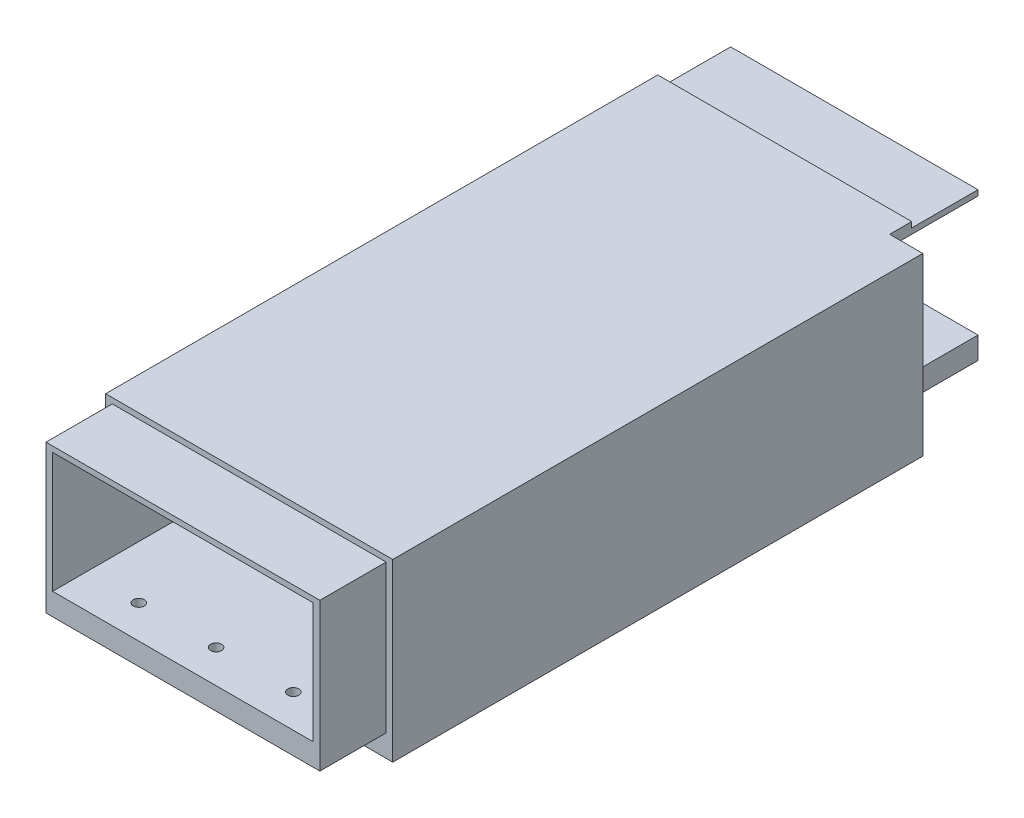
ISO-10303-21;
HEADER;
FILE_DESCRIPTION(('STEP AP214'),'2;1');
FILE_NAME('part.step','',(''),(''),'','','');
FILE_SCHEMA(('AUTOMOTIVE_DESIGN { 1 0 10303 214 1 1 1 1 }'));
ENDSEC;
DATA;
#1=APPLICATION_CONTEXT('core data for automotive mechanical design processes');
#2=APPLICATION_PROTOCOL_DEFINITION('international standard','automotive_design',2000,#1);
#3=PRODUCT_CONTEXT('',#1,'mechanical');
#4=PRODUCT('Part','Part','',(#3));
#5=PRODUCT_RELATED_PRODUCT_CATEGORY('part','',(#4));
#6=PRODUCT_DEFINITION_FORMATION('','',#4);
#7=PRODUCT_DEFINITION_CONTEXT('part definition',#1,'design');
#8=PRODUCT_DEFINITION('design','',#6,#7);
#9=PRODUCT_DEFINITION_SHAPE('','',#8);
#10=(LENGTH_UNIT() NAMED_UNIT(*) SI_UNIT(.MILLI.,.METRE.));
#11=(NAMED_UNIT(*) PLANE_ANGLE_UNIT() SI_UNIT($,.RADIAN.));
#12=(NAMED_UNIT(*) SI_UNIT($,.STERADIAN.) SOLID_ANGLE_UNIT());
#13=UNCERTAINTY_MEASURE_WITH_UNIT(LENGTH_MEASURE(1.E-05),#10,'distance_accuracy_value','');
#14=(GEOMETRIC_REPRESENTATION_CONTEXT(3) GLOBAL_UNCERTAINTY_ASSIGNED_CONTEXT((#13)) GLOBAL_UNIT_ASSIGNED_CONTEXT((#10,
#11,#12)) REPRESENTATION_CONTEXT('',''));
#15=CARTESIAN_POINT('',(0.,0.,0.));
#16=DIRECTION('',(0.,0.,1.));
#17=DIRECTION('',(1.,0.,0.));
#18=AXIS2_PLACEMENT_3D('',#15,#16,#17);
#19=CARTESIAN_POINT('',(-119.30239365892,140.01739571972,1571.88680099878));
#20=DIRECTION('',(0.,-1.,0.));
#21=DIRECTION('',(0.,0.,-1.));
#22=AXIS2_PLACEMENT_3D('',#19,#20,#21);
#23=PLANE('',#22);
#24=DIRECTION('',(0.,0.,1.));
#25=VECTOR('',#24,1.);
#26=CARTESIAN_POINT('',(-7.30239365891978,140.01739571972,1571.88680099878));
#27=LINE('',#26,#25);
#28=CARTESIAN_POINT('',(-7.30239365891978,140.01739571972,1400.00000000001));
#29=VERTEX_POINT('',#28);
#30=CARTESIAN_POINT('',(-7.30239365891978,140.01739571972,1430.00000000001));
#31=VERTEX_POINT('',#30);
#32=EDGE_CURVE('E211',#29,#31,#27,.T.);
#33=ORIENTED_EDGE('',*,*,#32,.F.);
#34=DIRECTION('',(-1.,0.,0.));
#35=VECTOR('',#34,1.);
#36=CARTESIAN_POINT('',(-119.30239365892,140.01739571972,1400.00000000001));
#37=LINE('',#36,#35);
#38=CARTESIAN_POINT('',(-119.30239365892,140.01739571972,1400.00000000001));
#39=VERTEX_POINT('',#38);
#40=EDGE_CURVE('E361',#29,#39,#37,.T.);
#41=ORIENTED_EDGE('',*,*,#40,.T.);
#42=DIRECTION('',(0.,0.,-1.));
#43=VECTOR('',#42,1.);
#44=CARTESIAN_POINT('',(-119.30239365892,140.01739571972,1571.88680099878));
#45=LINE('',#44,#43);
#46=CARTESIAN_POINT('',(-119.30239365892,140.01739571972,1430.00000000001));
#47=VERTEX_POINT('',#46);
#48=EDGE_CURVE('E47',#47,#39,#45,.T.);
#49=ORIENTED_EDGE('',*,*,#48,.F.);
#50=DIRECTION('',(-1.,0.,0.));
#51=VECTOR('',#50,1.);
#52=CARTESIAN_POINT('',(-119.30239365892,140.01739571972,1430.00000000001));
#53=LINE('',#52,#51);
#54=EDGE_CURVE('E328',#31,#47,#53,.T.);
#55=ORIENTED_EDGE('',*,*,#54,.F.);
#56=EDGE_LOOP('',(#33,#41,#49,#55));
#57=FACE_BOUND('',#56,.T.);
#58=ADVANCED_FACE('F39',(#57),#23,.F.);
#59=CARTESIAN_POINT('',(-119.30239365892,73.0246653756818,1571.88680099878));
#60=DIRECTION('',(0.,1.,0.));
#61=DIRECTION('',(0.,0.,1.));
#62=AXIS2_PLACEMENT_3D('',#59,#60,#61);
#63=PLANE('',#62);
#64=CARTESIAN_POINT('',(-22.3023936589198,73.0246653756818,1415.00000000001));
#65=DIRECTION('',(0.,-1.,0.));
#66=DIRECTION('',(0.,0.,-1.));
#67=AXIS2_PLACEMENT_3D('',#64,#65,#66);
#68=CIRCLE('',#67,2.49999999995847);
#69=CARTESIAN_POINT('',(-22.3023936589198,73.0246653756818,1412.50000000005));
#70=VERTEX_POINT('',#69);
#71=EDGE_CURVE('E231',#70,#70,#68,.T.);
#72=ORIENTED_EDGE('',*,*,#71,.F.);
#73=EDGE_LOOP('',(#72));
#74=FACE_BOUND('',#73,.T.);
#75=CARTESIAN_POINT('',(-57.3023936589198,73.0246653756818,1415.00000000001));
#76=DIRECTION('',(0.,-1.,0.));
#77=DIRECTION('',(0.,0.,-1.));
#78=AXIS2_PLACEMENT_3D('',#75,#76,#77);
#79=CIRCLE('',#78,2.49999999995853);
#80=CARTESIAN_POINT('',(-57.3023936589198,73.0246653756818,1412.50000000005));
#81=VERTEX_POINT('',#80);
#82=EDGE_CURVE('E252',#81,#81,#79,.T.);
#83=ORIENTED_EDGE('',*,*,#82,.F.);
#84=EDGE_LOOP('',(#83));
#85=FACE_BOUND('',#84,.T.);
#86=CARTESIAN_POINT('',(-92.3023936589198,73.0246653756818,1415.00000000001));
#87=DIRECTION('',(0.,-1.,0.));
#88=DIRECTION('',(0.,0.,-1.));
#89=AXIS2_PLACEMENT_3D('',#86,#87,#88);
#90=CIRCLE('',#89,2.49999999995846);
#91=CARTESIAN_POINT('',(-92.3023936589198,73.0246653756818,1412.50000000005));
#92=VERTEX_POINT('',#91);
#93=EDGE_CURVE('E242',#92,#92,#90,.T.);
#94=ORIENTED_EDGE('',*,*,#93,.F.);
#95=EDGE_LOOP('',(#94));
#96=FACE_BOUND('',#95,.T.);
#97=DIRECTION('',(0.,0.,-1.));
#98=VECTOR('',#97,1.);
#99=CARTESIAN_POINT('',(-7.30239365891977,73.0246653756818,1571.88680099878));
#100=LINE('',#99,#98);
#101=CARTESIAN_POINT('',(-7.30239365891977,73.0246653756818,1430.00000000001));
#102=VERTEX_POINT('',#101);
#103=CARTESIAN_POINT('',(-7.30239365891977,73.0246653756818,1400.00000000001));
#104=VERTEX_POINT('',#103);
#105=EDGE_CURVE('E204',#102,#104,#100,.T.);
#106=ORIENTED_EDGE('',*,*,#105,.F.);
#107=DIRECTION('',(1.,0.,0.));
#108=VECTOR('',#107,1.);
#109=CARTESIAN_POINT('',(-119.30239365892,73.0246653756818,1430.00000000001));
#110=LINE('',#109,#108);
#111=CARTESIAN_POINT('',(-119.30239365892,73.0246653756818,1430.00000000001));
#112=VERTEX_POINT('',#111);
#113=EDGE_CURVE('E330',#112,#102,#110,.T.);
#114=ORIENTED_EDGE('',*,*,#113,.F.);
#115=DIRECTION('',(0.,0.,-1.));
#116=VECTOR('',#115,1.);
#117=CARTESIAN_POINT('',(-119.30239365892,73.0246653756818,1571.88680099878));
#118=LINE('',#117,#116);
#119=CARTESIAN_POINT('',(-119.30239365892,73.0246653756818,1400.00000000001));
#120=VERTEX_POINT('',#119);
#121=EDGE_CURVE('E11',#112,#120,#118,.T.);
#122=ORIENTED_EDGE('',*,*,#121,.T.);
#123=DIRECTION('',(1.,0.,0.));
#124=VECTOR('',#123,1.);
#125=CARTESIAN_POINT('',(-119.30239365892,73.0246653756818,1400.00000000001));
#126=LINE('',#125,#124);
#127=EDGE_CURVE('E358',#120,#104,#126,.T.);
#128=ORIENTED_EDGE('',*,*,#127,.T.);
#129=EDGE_LOOP('',(#106,#114,#122,#128));
#130=FACE_BOUND('',#129,.T.);
#131=ADVANCED_FACE('F378',(#74,#85,#96,#130),#63,.F.);
#132=CARTESIAN_POINT('',(0.,0.,1400.00000000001));
#133=DIRECTION('',(0.,0.,1.));
#134=DIRECTION('',(1.,0.,0.));
#135=AXIS2_PLACEMENT_3D('',#132,#133,#134);
#136=PLANE('',#135);
#137=DIRECTION('',(0.,1.,0.));
#138=VECTOR('',#137,1.);
#139=CARTESIAN_POINT('',(-7.30239365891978,142.51739571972,1400.00000000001));
#140=LINE('',#139,#138);
#141=CARTESIAN_POINT('',(-7.30239365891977,83.0246653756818,1400.00000000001));
#142=VERTEX_POINT('',#141);
#143=EDGE_CURVE('E186',#104,#142,#140,.T.);
#144=ORIENTED_EDGE('',*,*,#143,.F.);
#145=ORIENTED_EDGE('',*,*,#127,.F.);
#146=DIRECTION('',(0.,-1.,0.));
#147=VECTOR('',#146,1.);
#148=CARTESIAN_POINT('',(-119.30239365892,140.01739571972,1400.00000000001));
#149=LINE('',#148,#147);
#150=EDGE_CURVE('E355',#39,#120,#149,.T.);
#151=ORIENTED_EDGE('',*,*,#150,.F.);
#152=ORIENTED_EDGE('',*,*,#40,.F.);
#153=CARTESIAN_POINT('',(-7.30239365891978,137.51739571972,1400.00000000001));
#154=VERTEX_POINT('',#153);
#155=EDGE_CURVE('E382',#154,#29,#140,.T.);
#156=ORIENTED_EDGE('',*,*,#155,.F.);
#157=DIRECTION('',(-1.,0.,0.));
#158=VECTOR('',#157,1.);
#159=CARTESIAN_POINT('',(-116.30239365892,137.51739571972,1400.00000000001));
#160=LINE('',#159,#158);
#161=CARTESIAN_POINT('',(-116.30239365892,137.51739571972,1400.00000000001));
#162=VERTEX_POINT('',#161);
#163=EDGE_CURVE('E342',#154,#162,#160,.T.);
#164=ORIENTED_EDGE('',*,*,#163,.T.);
#165=DIRECTION('',(0.,-1.,0.));
#166=VECTOR('',#165,1.);
#167=CARTESIAN_POINT('',(-116.30239365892,137.51739571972,1400.00000000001));
#168=LINE('',#167,#166);
#169=CARTESIAN_POINT('',(-116.30239365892,83.0246653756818,1400.00000000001));
#170=VERTEX_POINT('',#169);
#171=EDGE_CURVE('E336',#162,#170,#168,.T.);
#172=ORIENTED_EDGE('',*,*,#171,.T.);
#173=DIRECTION('',(1.,0.,0.));
#174=VECTOR('',#173,1.);
#175=CARTESIAN_POINT('',(-116.30239365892,83.0246653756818,1400.00000000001));
#176=LINE('',#175,#174);
#177=EDGE_CURVE('E339',#170,#142,#176,.T.);
#178=ORIENTED_EDGE('',*,*,#177,.T.);
#179=EDGE_LOOP('',(#144,#145,#151,#152,#156,#164,#172,#178));
#180=FACE_BOUND('',#179,.T.);
#181=ADVANCED_FACE('F374',(#180),#136,.F.);
#182=CARTESIAN_POINT('',(0.,0.,1430.00000000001));
#183=DIRECTION('',(0.,0.,-1.));
#184=DIRECTION('',(-1.,0.,0.));
#185=AXIS2_PLACEMENT_3D('',#182,#183,#184);
#186=PLANE('',#185);
#187=DIRECTION('',(-1.,0.,0.));
#188=VECTOR('',#187,1.);
#189=CARTESIAN_POINT('',(-122.30239365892,142.51739571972,1430.00000000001));
#190=LINE('',#189,#188);
#191=CARTESIAN_POINT('',(-7.30239365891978,142.51739571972,1430.00000000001));
#192=VERTEX_POINT('',#191);
#193=CARTESIAN_POINT('',(-122.30239365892,142.51739571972,1430.00000000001));
#194=VERTEX_POINT('',#193);
#195=EDGE_CURVE('E306',#192,#194,#190,.T.);
#196=ORIENTED_EDGE('',*,*,#195,.F.);
#197=DIRECTION('',(0.,-1.,0.));
#198=VECTOR('',#197,1.);
#199=CARTESIAN_POINT('',(-7.30239365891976,0.,1430.00000000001));
#200=LINE('',#199,#198);
#201=EDGE_CURVE('E182',#192,#31,#200,.T.);
#202=ORIENTED_EDGE('',*,*,#201,.T.);
#203=ORIENTED_EDGE('',*,*,#54,.T.);
#204=DIRECTION('',(0.,-1.,0.));
#205=VECTOR('',#204,1.);
#206=CARTESIAN_POINT('',(-119.30239365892,140.01739571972,1430.00000000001));
#207=LINE('',#206,#205);
#208=EDGE_CURVE('E333',#47,#112,#207,.T.);
#209=ORIENTED_EDGE('',*,*,#208,.T.);
#210=ORIENTED_EDGE('',*,*,#113,.T.);
#211=CARTESIAN_POINT('',(-7.30239365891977,63.0246653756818,1430.00000000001));
#212=VERTEX_POINT('',#211);
#213=EDGE_CURVE('E201',#102,#212,#200,.T.);
#214=ORIENTED_EDGE('',*,*,#213,.T.);
#215=DIRECTION('',(1.,0.,0.));
#216=VECTOR('',#215,1.);
#217=CARTESIAN_POINT('',(-122.30239365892,63.0246653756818,1430.00000000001));
#218=LINE('',#217,#216);
#219=CARTESIAN_POINT('',(-122.30239365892,63.0246653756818,1430.00000000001));
#220=VERTEX_POINT('',#219);
#221=EDGE_CURVE('E315',#220,#212,#218,.T.);
#222=ORIENTED_EDGE('',*,*,#221,.F.);
#223=DIRECTION('',(0.,-1.,0.));
#224=VECTOR('',#223,1.);
#225=CARTESIAN_POINT('',(-122.30239365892,63.0246653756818,1430.00000000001));
#226=LINE('',#225,#224);
#227=EDGE_CURVE('E301',#194,#220,#226,.T.);
#228=ORIENTED_EDGE('',*,*,#227,.F.);
#229=EDGE_LOOP('',(#196,#202,#203,#209,#210,#214,#222,#228));
#230=FACE_BOUND('',#229,.T.);
#231=ADVANCED_FACE('F380',(#230),#186,.T.);
#232=CARTESIAN_POINT('',(0.,0.,1680.00000000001));
#233=DIRECTION('',(0.,0.,-1.));
#234=DIRECTION('',(-1.,0.,0.));
#235=AXIS2_PLACEMENT_3D('',#232,#233,#234);
#236=PLANE('',#235);
#237=DIRECTION('',(0.,-1.,0.));
#238=VECTOR('',#237,1.);
#239=CARTESIAN_POINT('',(-122.30239365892,63.0246653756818,1680.00000000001));
#240=LINE('',#239,#238);
#241=CARTESIAN_POINT('',(-122.30239365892,142.51739571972,1680.00000000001));
#242=VERTEX_POINT('',#241);
#243=CARTESIAN_POINT('',(-122.30239365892,63.0246653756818,1680.00000000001));
#244=VERTEX_POINT('',#243);
#245=EDGE_CURVE('E302',#242,#244,#240,.T.);
#246=ORIENTED_EDGE('',*,*,#245,.T.);
#247=DIRECTION('',(1.,0.,0.));
#248=VECTOR('',#247,1.);
#249=CARTESIAN_POINT('',(-122.30239365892,63.0246653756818,1680.00000000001));
#250=LINE('',#249,#248);
#251=CARTESIAN_POINT('',(7.69760634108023,63.0246653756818,1680.00000000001));
#252=VERTEX_POINT('',#251);
#253=EDGE_CURVE('E305',#244,#252,#250,.T.);
#254=ORIENTED_EDGE('',*,*,#253,.T.);
#255=DIRECTION('',(0.,1.,0.));
#256=VECTOR('',#255,1.);
#257=CARTESIAN_POINT('',(7.69760634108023,63.0246653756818,1680.00000000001));
#258=LINE('',#257,#256);
#259=CARTESIAN_POINT('',(7.69760634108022,142.51739571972,1680.00000000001));
#260=VERTEX_POINT('',#259);
#261=EDGE_CURVE('E308',#252,#260,#258,.T.);
#262=ORIENTED_EDGE('',*,*,#261,.T.);
#263=DIRECTION('',(-1.,0.,0.));
#264=VECTOR('',#263,1.);
#265=CARTESIAN_POINT('',(-122.30239365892,142.51739571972,1680.00000000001));
#266=LINE('',#265,#264);
#267=EDGE_CURVE('E310',#260,#242,#266,.T.);
#268=ORIENTED_EDGE('',*,*,#267,.T.);
#269=EDGE_LOOP('',(#246,#254,#262,#268));
#270=FACE_BOUND('',#269,.T.);
#271=DIRECTION('',(0.,-1.,0.));
#272=VECTOR('',#271,1.);
#273=CARTESIAN_POINT('',(-119.30239365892,140.01739571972,1680.00000000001));
#274=LINE('',#273,#272);
#275=CARTESIAN_POINT('',(-119.30239365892,140.01739571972,1680.00000000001));
#276=VERTEX_POINT('',#275);
#277=CARTESIAN_POINT('',(-119.30239365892,73.0246653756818,1680.00000000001));
#278=VERTEX_POINT('',#277);
#279=EDGE_CURVE('E62',#276,#278,#274,.T.);
#280=ORIENTED_EDGE('',*,*,#279,.F.);
#281=DIRECTION('',(-1.,0.,0.));
#282=VECTOR('',#281,1.);
#283=CARTESIAN_POINT('',(-119.30239365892,140.01739571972,1680.00000000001));
#284=LINE('',#283,#282);
#285=CARTESIAN_POINT('',(4.69760634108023,140.01739571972,1680.00000000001));
#286=VERTEX_POINT('',#285);
#287=EDGE_CURVE('E275',#286,#276,#284,.T.);
#288=ORIENTED_EDGE('',*,*,#287,.F.);
#289=DIRECTION('',(0.,1.,0.));
#290=VECTOR('',#289,1.);
#291=CARTESIAN_POINT('',(4.69760634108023,140.01739571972,1680.00000000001));
#292=LINE('',#291,#290);
#293=CARTESIAN_POINT('',(4.69760634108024,73.0246653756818,1680.00000000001));
#294=VERTEX_POINT('',#293);
#295=EDGE_CURVE('E286',#294,#286,#292,.T.);
#296=ORIENTED_EDGE('',*,*,#295,.F.);
#297=DIRECTION('',(1.,0.,0.));
#298=VECTOR('',#297,1.);
#299=CARTESIAN_POINT('',(-119.30239365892,73.0246653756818,1680.00000000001));
#300=LINE('',#299,#298);
#301=EDGE_CURVE('E283',#278,#294,#300,.T.);
#302=ORIENTED_EDGE('',*,*,#301,.F.);
#303=EDGE_LOOP('',(#280,#288,#296,#302));
#304=FACE_BOUND('',#303,.T.);
#305=ADVANCED_FACE('F399',(#270,#304),#236,.F.);
#306=CARTESIAN_POINT('',(-119.30239365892,140.01739571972,1571.88680099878));
#307=DIRECTION('',(1.,0.,0.));
#308=DIRECTION('',(0.,1.,0.));
#309=AXIS2_PLACEMENT_3D('',#306,#307,#308);
#310=PLANE('',#309);
#311=ORIENTED_EDGE('',*,*,#208,.F.);
#312=ORIENTED_EDGE('',*,*,#48,.T.);
#313=ORIENTED_EDGE('',*,*,#150,.T.);
#314=ORIENTED_EDGE('',*,*,#121,.F.);
#315=EDGE_LOOP('',(#311,#312,#313,#314));
#316=FACE_BOUND('',#315,.T.);
#317=ADVANCED_FACE('F41',(#316),#310,.F.);
#318=CARTESIAN_POINT('',(-116.30239365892,137.51739571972,1571.88680099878));
#319=DIRECTION('',(0.,-1.,0.));
#320=DIRECTION('',(0.,0.,-1.));
#321=AXIS2_PLACEMENT_3D('',#318,#319,#320);
#322=PLANE('',#321);
#323=DIRECTION('',(-1.,0.,0.));
#324=VECTOR('',#323,1.);
#325=CARTESIAN_POINT('',(-116.30239365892,137.51739571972,1440.00000000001));
#326=LINE('',#325,#324);
#327=CARTESIAN_POINT('',(1.69760634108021,137.51739571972,1440.00000000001));
#328=VERTEX_POINT('',#327);
#329=CARTESIAN_POINT('',(-7.30239365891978,137.51739571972,1440.00000000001));
#330=VERTEX_POINT('',#329);
#331=EDGE_CURVE('E192',#328,#330,#326,.T.);
#332=ORIENTED_EDGE('',*,*,#331,.F.);
#333=DIRECTION('',(0.,0.,-1.));
#334=VECTOR('',#333,1.);
#335=CARTESIAN_POINT('',(1.69760634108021,137.51739571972,1571.88680099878));
#336=LINE('',#335,#334);
#337=CARTESIAN_POINT('',(1.6976063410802,137.51739571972,1710.00000000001));
#338=VERTEX_POINT('',#337);
#339=EDGE_CURVE('E347',#338,#328,#336,.T.);
#340=ORIENTED_EDGE('',*,*,#339,.F.);
#341=DIRECTION('',(-1.,0.,0.));
#342=VECTOR('',#341,1.);
#343=CARTESIAN_POINT('',(-116.30239365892,137.51739571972,1710.00000000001));
#344=LINE('',#343,#342);
#345=CARTESIAN_POINT('',(-116.30239365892,137.51739571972,1710.00000000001));
#346=VERTEX_POINT('',#345);
#347=EDGE_CURVE('E268',#338,#346,#344,.T.);
#348=ORIENTED_EDGE('',*,*,#347,.T.);
#349=DIRECTION('',(0.,0.,-1.));
#350=VECTOR('',#349,1.);
#351=CARTESIAN_POINT('',(-116.30239365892,137.51739571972,1571.88680099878));
#352=LINE('',#351,#350);
#353=EDGE_CURVE('E344',#346,#162,#352,.T.);
#354=ORIENTED_EDGE('',*,*,#353,.T.);
#355=ORIENTED_EDGE('',*,*,#163,.F.);
#356=DIRECTION('',(0.,0.,1.));
#357=VECTOR('',#356,1.);
#358=CARTESIAN_POINT('',(-7.30239365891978,137.51739571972,1571.88680099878));
#359=LINE('',#358,#357);
#360=EDGE_CURVE('E216',#154,#330,#359,.T.);
#361=ORIENTED_EDGE('',*,*,#360,.T.);
#362=EDGE_LOOP('',(#332,#340,#348,#354,#355,#361));
#363=FACE_BOUND('',#362,.T.);
#364=ADVANCED_FACE('F432',(#363),#322,.T.);
#365=CARTESIAN_POINT('',(1.69760634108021,137.51739571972,1571.88680099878));
#366=DIRECTION('',(-1.,0.,0.));
#367=DIRECTION('',(0.,-1.,0.));
#368=AXIS2_PLACEMENT_3D('',#365,#366,#367);
#369=PLANE('',#368);
#370=DIRECTION('',(0.,1.,0.));
#371=VECTOR('',#370,1.);
#372=CARTESIAN_POINT('',(1.69760634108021,137.51739571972,1440.00000000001));
#373=LINE('',#372,#371);
#374=CARTESIAN_POINT('',(1.69760634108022,83.0246653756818,1440.00000000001));
#375=VERTEX_POINT('',#374);
#376=EDGE_CURVE('E220',#375,#328,#373,.T.);
#377=ORIENTED_EDGE('',*,*,#376,.F.);
#378=DIRECTION('',(0.,0.,-1.));
#379=VECTOR('',#378,1.);
#380=CARTESIAN_POINT('',(1.69760634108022,83.0246653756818,1571.88680099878));
#381=LINE('',#380,#379);
#382=CARTESIAN_POINT('',(1.6976063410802,83.0246653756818,1710.00000000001));
#383=VERTEX_POINT('',#382);
#384=EDGE_CURVE('E350',#383,#375,#381,.T.);
#385=ORIENTED_EDGE('',*,*,#384,.F.);
#386=DIRECTION('',(0.,1.,0.));
#387=VECTOR('',#386,1.);
#388=CARTESIAN_POINT('',(1.6976063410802,137.51739571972,1710.00000000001));
#389=LINE('',#388,#387);
#390=EDGE_CURVE('E265',#383,#338,#389,.T.);
#391=ORIENTED_EDGE('',*,*,#390,.T.);
#392=ORIENTED_EDGE('',*,*,#339,.T.);
#393=EDGE_LOOP('',(#377,#385,#391,#392));
#394=FACE_BOUND('',#393,.T.);
#395=ADVANCED_FACE('F428',(#394),#369,.T.);
#396=CARTESIAN_POINT('',(-116.30239365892,83.0246653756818,1571.88680099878));
#397=DIRECTION('',(0.,1.,0.));
#398=DIRECTION('',(0.,0.,1.));
#399=AXIS2_PLACEMENT_3D('',#396,#397,#398);
#400=PLANE('',#399);
#401=DIRECTION('',(1.,0.,0.));
#402=VECTOR('',#401,1.);
#403=CARTESIAN_POINT('',(-116.30239365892,83.0246653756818,1440.00000000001));
#404=LINE('',#403,#402);
#405=CARTESIAN_POINT('',(-7.30239365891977,83.0246653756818,1440.00000000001));
#406=VERTEX_POINT('',#405);
#407=EDGE_CURVE('E218',#406,#375,#404,.T.);
#408=ORIENTED_EDGE('',*,*,#407,.F.);
#409=DIRECTION('',(0.,0.,-1.));
#410=VECTOR('',#409,1.);
#411=CARTESIAN_POINT('',(-7.30239365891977,83.0246653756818,1571.88680099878));
#412=LINE('',#411,#410);
#413=EDGE_CURVE('E213',#406,#142,#412,.T.);
#414=ORIENTED_EDGE('',*,*,#413,.T.);
#415=ORIENTED_EDGE('',*,*,#177,.F.);
#416=DIRECTION('',(0.,0.,-1.));
#417=VECTOR('',#416,1.);
#418=CARTESIAN_POINT('',(-116.30239365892,83.0246653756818,1571.88680099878));
#419=LINE('',#418,#417);
#420=CARTESIAN_POINT('',(-116.30239365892,83.0246653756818,1710.00000000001));
#421=VERTEX_POINT('',#420);
#422=EDGE_CURVE('E353',#421,#170,#419,.T.);
#423=ORIENTED_EDGE('',*,*,#422,.F.);
#424=DIRECTION('',(1.,0.,0.));
#425=VECTOR('',#424,1.);
#426=CARTESIAN_POINT('',(-116.30239365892,83.0246653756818,1710.00000000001));
#427=LINE('',#426,#425);
#428=EDGE_CURVE('E262',#421,#383,#427,.T.);
#429=ORIENTED_EDGE('',*,*,#428,.T.);
#430=ORIENTED_EDGE('',*,*,#384,.T.);
#431=EDGE_LOOP('',(#408,#414,#415,#423,#429,#430));
#432=FACE_BOUND('',#431,.T.);
#433=CARTESIAN_POINT('',(-92.3023936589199,83.0246653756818,1695.00000000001));
#434=DIRECTION('',(0.,1.,0.));
#435=DIRECTION('',(0.,0.,1.));
#436=AXIS2_PLACEMENT_3D('',#433,#434,#435);
#437=CIRCLE('',#436,2.49999999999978);
#438=CARTESIAN_POINT('',(-92.3023936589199,83.0246653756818,1697.50000000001));
#439=VERTEX_POINT('',#438);
#440=EDGE_CURVE('E224',#439,#439,#437,.F.);
#441=ORIENTED_EDGE('',*,*,#440,.T.);
#442=EDGE_LOOP('',(#441));
#443=FACE_BOUND('',#442,.T.);
#444=CARTESIAN_POINT('',(-57.3023936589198,83.0246653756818,1695.00000000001));
#445=DIRECTION('',(0.,1.,0.));
#446=DIRECTION('',(0.,0.,1.));
#447=AXIS2_PLACEMENT_3D('',#444,#445,#446);
#448=CIRCLE('',#447,2.50000000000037);
#449=CARTESIAN_POINT('',(-57.3023936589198,83.0246653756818,1697.50000000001));
#450=VERTEX_POINT('',#449);
#451=EDGE_CURVE('E228',#450,#450,#448,.F.);
#452=ORIENTED_EDGE('',*,*,#451,.T.);
#453=EDGE_LOOP('',(#452));
#454=FACE_BOUND('',#453,.T.);
#455=CARTESIAN_POINT('',(-22.3023936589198,83.0246653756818,1695.00000000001));
#456=DIRECTION('',(0.,1.,0.));
#457=DIRECTION('',(0.,0.,1.));
#458=AXIS2_PLACEMENT_3D('',#455,#456,#457);
#459=CIRCLE('',#458,2.49999999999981);
#460=CARTESIAN_POINT('',(-22.3023936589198,83.0246653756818,1697.50000000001));
#461=VERTEX_POINT('',#460);
#462=EDGE_CURVE('E235',#461,#461,#459,.F.);
#463=ORIENTED_EDGE('',*,*,#462,.T.);
#464=EDGE_LOOP('',(#463));
#465=FACE_BOUND('',#464,.T.);
#466=CARTESIAN_POINT('',(-92.3023936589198,83.0246653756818,1415.00000000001));
#467=DIRECTION('',(0.,1.,0.));
#468=DIRECTION('',(0.,0.,1.));
#469=AXIS2_PLACEMENT_3D('',#466,#467,#468);
#470=CIRCLE('',#469,2.49999999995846);
#471=CARTESIAN_POINT('',(-92.3023936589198,83.0246653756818,1417.49999999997));
#472=VERTEX_POINT('',#471);
#473=EDGE_CURVE('E246',#472,#472,#470,.F.);
#474=ORIENTED_EDGE('',*,*,#473,.T.);
#475=EDGE_LOOP('',(#474));
#476=FACE_BOUND('',#475,.T.);
#477=CARTESIAN_POINT('',(-57.3023936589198,83.0246653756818,1415.00000000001));
#478=DIRECTION('',(0.,1.,0.));
#479=DIRECTION('',(0.,0.,1.));
#480=AXIS2_PLACEMENT_3D('',#477,#478,#479);
#481=CIRCLE('',#480,2.49999999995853);
#482=CARTESIAN_POINT('',(-57.3023936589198,83.0246653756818,1417.49999999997));
#483=VERTEX_POINT('',#482);
#484=EDGE_CURVE('E249',#483,#483,#481,.F.);
#485=ORIENTED_EDGE('',*,*,#484,.T.);
#486=EDGE_LOOP('',(#485));
#487=FACE_BOUND('',#486,.T.);
#488=CARTESIAN_POINT('',(-22.3023936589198,83.0246653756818,1415.00000000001));
#489=DIRECTION('',(0.,1.,0.));
#490=DIRECTION('',(0.,0.,1.));
#491=AXIS2_PLACEMENT_3D('',#488,#489,#490);
#492=CIRCLE('',#491,2.49999999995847);
#493=CARTESIAN_POINT('',(-22.3023936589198,83.0246653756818,1417.49999999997));
#494=VERTEX_POINT('',#493);
#495=EDGE_CURVE('E255',#494,#494,#492,.F.);
#496=ORIENTED_EDGE('',*,*,#495,.T.);
#497=EDGE_LOOP('',(#496));
#498=FACE_BOUND('',#497,.T.);
#499=ADVANCED_FACE('F424',(#432,#443,#454,#465,#476,#487,#498),#400,.T.);
#500=CARTESIAN_POINT('',(-116.30239365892,137.51739571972,1571.88680099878));
#501=DIRECTION('',(1.,0.,0.));
#502=DIRECTION('',(0.,0.,-1.));
#503=AXIS2_PLACEMENT_3D('',#500,#501,#502);
#504=PLANE('',#503);
#505=ORIENTED_EDGE('',*,*,#353,.F.);
#506=DIRECTION('',(0.,-1.,0.));
#507=VECTOR('',#506,1.);
#508=CARTESIAN_POINT('',(-116.30239365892,137.51739571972,1710.00000000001));
#509=LINE('',#508,#507);
#510=EDGE_CURVE('E245',#346,#421,#509,.T.);
#511=ORIENTED_EDGE('',*,*,#510,.T.);
#512=ORIENTED_EDGE('',*,*,#422,.T.);
#513=ORIENTED_EDGE('',*,*,#171,.F.);
#514=EDGE_LOOP('',(#505,#511,#512,#513));
#515=FACE_BOUND('',#514,.T.);
#516=ADVANCED_FACE('F410',(#515),#504,.T.);
#517=CARTESIAN_POINT('',(-122.30239365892,142.51739571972,1680.00000000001));
#518=DIRECTION('',(0.,-1.,0.));
#519=DIRECTION('',(0.,0.,-1.));
#520=AXIS2_PLACEMENT_3D('',#517,#518,#519);
#521=PLANE('',#520);
#522=DIRECTION('',(0.,0.,-1.));
#523=VECTOR('',#522,1.);
#524=CARTESIAN_POINT('',(7.69760634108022,142.51739571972,1680.00000000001));
#525=LINE('',#524,#523);
#526=CARTESIAN_POINT('',(7.69760634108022,142.51739571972,1440.00000000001));
#527=VERTEX_POINT('',#526);
#528=EDGE_CURVE('E200',#260,#527,#525,.T.);
#529=ORIENTED_EDGE('',*,*,#528,.T.);
#530=DIRECTION('',(1.,0.,0.));
#531=VECTOR('',#530,1.);
#532=CARTESIAN_POINT('',(-7.30239365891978,142.51739571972,1440.00000000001));
#533=LINE('',#532,#531);
#534=CARTESIAN_POINT('',(-7.30239365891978,142.51739571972,1440.00000000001));
#535=VERTEX_POINT('',#534);
#536=EDGE_CURVE('E189',#535,#527,#533,.T.);
#537=ORIENTED_EDGE('',*,*,#536,.F.);
#538=DIRECTION('',(0.,0.,1.));
#539=VECTOR('',#538,1.);
#540=CARTESIAN_POINT('',(-7.30239365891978,142.51739571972,1440.00000000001));
#541=LINE('',#540,#539);
#542=EDGE_CURVE('E176',#192,#535,#541,.T.);
#543=ORIENTED_EDGE('',*,*,#542,.F.);
#544=ORIENTED_EDGE('',*,*,#195,.T.);
#545=DIRECTION('',(0.,0.,-1.));
#546=VECTOR('',#545,1.);
#547=CARTESIAN_POINT('',(-122.30239365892,142.51739571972,1680.00000000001));
#548=LINE('',#547,#546);
#549=EDGE_CURVE('E312',#242,#194,#548,.T.);
#550=ORIENTED_EDGE('',*,*,#549,.F.);
#551=ORIENTED_EDGE('',*,*,#267,.F.);
#552=EDGE_LOOP('',(#529,#537,#543,#544,#550,#551));
#553=FACE_BOUND('',#552,.T.);
#554=ADVANCED_FACE('F197',(#553),#521,.F.);
#555=CARTESIAN_POINT('',(7.69760634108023,63.0246653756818,1680.00000000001));
#556=DIRECTION('',(-1.,0.,0.));
#557=DIRECTION('',(0.,-1.,0.));
#558=AXIS2_PLACEMENT_3D('',#555,#556,#557);
#559=PLANE('',#558);
#560=DIRECTION('',(0.,0.,-1.));
#561=VECTOR('',#560,1.);
#562=CARTESIAN_POINT('',(7.69760634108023,63.0246653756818,1680.00000000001));
#563=LINE('',#562,#561);
#564=CARTESIAN_POINT('',(7.69760634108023,63.0246653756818,1440.00000000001));
#565=VERTEX_POINT('',#564);
#566=EDGE_CURVE('E322',#252,#565,#563,.T.);
#567=ORIENTED_EDGE('',*,*,#566,.T.);
#568=DIRECTION('',(0.,-1.,0.));
#569=VECTOR('',#568,1.);
#570=CARTESIAN_POINT('',(7.69760634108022,142.51739571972,1440.00000000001));
#571=LINE('',#570,#569);
#572=EDGE_CURVE('E208',#527,#565,#571,.T.);
#573=ORIENTED_EDGE('',*,*,#572,.F.);
#574=ORIENTED_EDGE('',*,*,#528,.F.);
#575=ORIENTED_EDGE('',*,*,#261,.F.);
#576=EDGE_LOOP('',(#567,#573,#574,#575));
#577=FACE_BOUND('',#576,.T.);
#578=ADVANCED_FACE('F402',(#577),#559,.F.);
#579=CARTESIAN_POINT('',(-122.30239365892,63.0246653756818,1680.00000000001));
#580=DIRECTION('',(0.,1.,0.));
#581=DIRECTION('',(0.,0.,1.));
#582=AXIS2_PLACEMENT_3D('',#579,#580,#581);
#583=PLANE('',#582);
#584=DIRECTION('',(0.,0.,-1.));
#585=VECTOR('',#584,1.);
#586=CARTESIAN_POINT('',(-7.30239365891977,63.0246653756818,1440.00000000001));
#587=LINE('',#586,#585);
#588=CARTESIAN_POINT('',(-7.30239365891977,63.0246653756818,1440.00000000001));
#589=VERTEX_POINT('',#588);
#590=EDGE_CURVE('E193',#589,#212,#587,.T.);
#591=ORIENTED_EDGE('',*,*,#590,.F.);
#592=DIRECTION('',(1.,0.,0.));
#593=VECTOR('',#592,1.);
#594=CARTESIAN_POINT('',(-7.30239365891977,63.0246653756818,1440.00000000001));
#595=LINE('',#594,#593);
#596=EDGE_CURVE('E54',#589,#565,#595,.T.);
#597=ORIENTED_EDGE('',*,*,#596,.T.);
#598=ORIENTED_EDGE('',*,*,#566,.F.);
#599=ORIENTED_EDGE('',*,*,#253,.F.);
#600=DIRECTION('',(0.,0.,-1.));
#601=VECTOR('',#600,1.);
#602=CARTESIAN_POINT('',(-122.30239365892,63.0246653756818,1680.00000000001));
#603=LINE('',#602,#601);
#604=EDGE_CURVE('E325',#244,#220,#603,.T.);
#605=ORIENTED_EDGE('',*,*,#604,.T.);
#606=ORIENTED_EDGE('',*,*,#221,.T.);
#607=EDGE_LOOP('',(#591,#597,#598,#599,#605,#606));
#608=FACE_BOUND('',#607,.T.);
#609=ADVANCED_FACE('F391',(#608),#583,.F.);
#610=CARTESIAN_POINT('',(-122.30239365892,63.0246653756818,1680.00000000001));
#611=DIRECTION('',(1.,0.,0.));
#612=DIRECTION('',(0.,1.,0.));
#613=AXIS2_PLACEMENT_3D('',#610,#611,#612);
#614=PLANE('',#613);
#615=ORIENTED_EDGE('',*,*,#227,.T.);
#616=ORIENTED_EDGE('',*,*,#604,.F.);
#617=ORIENTED_EDGE('',*,*,#245,.F.);
#618=ORIENTED_EDGE('',*,*,#549,.T.);
#619=EDGE_LOOP('',(#615,#616,#617,#618));
#620=FACE_BOUND('',#619,.T.);
#621=ADVANCED_FACE('F396',(#620),#614,.F.);
#622=CARTESIAN_POINT('',(0.,0.,1710.00000000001));
#623=DIRECTION('',(0.,0.,1.));
#624=DIRECTION('',(1.,0.,0.));
#625=AXIS2_PLACEMENT_3D('',#622,#623,#624);
#626=PLANE('',#625);
#627=DIRECTION('',(0.,-1.,0.));
#628=VECTOR('',#627,1.);
#629=CARTESIAN_POINT('',(-119.30239365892,140.01739571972,1710.00000000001));
#630=LINE('',#629,#628);
#631=CARTESIAN_POINT('',(-119.30239365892,140.01739571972,1710.00000000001));
#632=VERTEX_POINT('',#631);
#633=CARTESIAN_POINT('',(-119.30239365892,73.0246653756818,1710.00000000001));
#634=VERTEX_POINT('',#633);
#635=EDGE_CURVE('E271',#632,#634,#630,.T.);
#636=ORIENTED_EDGE('',*,*,#635,.T.);
#637=DIRECTION('',(1.,0.,0.));
#638=VECTOR('',#637,1.);
#639=CARTESIAN_POINT('',(-119.30239365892,73.0246653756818,1710.00000000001));
#640=LINE('',#639,#638);
#641=CARTESIAN_POINT('',(4.69760634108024,73.0246653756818,1710.00000000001));
#642=VERTEX_POINT('',#641);
#643=EDGE_CURVE('E274',#634,#642,#640,.T.);
#644=ORIENTED_EDGE('',*,*,#643,.T.);
#645=DIRECTION('',(0.,1.,0.));
#646=VECTOR('',#645,1.);
#647=CARTESIAN_POINT('',(4.69760634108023,140.01739571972,1710.00000000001));
#648=LINE('',#647,#646);
#649=CARTESIAN_POINT('',(4.69760634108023,140.01739571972,1710.00000000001));
#650=VERTEX_POINT('',#649);
#651=EDGE_CURVE('E277',#642,#650,#648,.T.);
#652=ORIENTED_EDGE('',*,*,#651,.T.);
#653=DIRECTION('',(-1.,0.,0.));
#654=VECTOR('',#653,1.);
#655=CARTESIAN_POINT('',(-119.30239365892,140.01739571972,1710.00000000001));
#656=LINE('',#655,#654);
#657=EDGE_CURVE('E279',#650,#632,#656,.T.);
#658=ORIENTED_EDGE('',*,*,#657,.T.);
#659=EDGE_LOOP('',(#636,#644,#652,#658));
#660=FACE_BOUND('',#659,.T.);
#661=ORIENTED_EDGE('',*,*,#428,.F.);
#662=ORIENTED_EDGE('',*,*,#510,.F.);
#663=ORIENTED_EDGE('',*,*,#347,.F.);
#664=ORIENTED_EDGE('',*,*,#390,.F.);
#665=EDGE_LOOP('',(#661,#662,#663,#664));
#666=FACE_BOUND('',#665,.T.);
#667=ADVANCED_FACE('F438',(#660,#666),#626,.T.);
#668=CARTESIAN_POINT('',(-119.30239365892,140.01739571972,1710.00000000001));
#669=DIRECTION('',(1.,0.,0.));
#670=DIRECTION('',(0.,1.,0.));
#671=AXIS2_PLACEMENT_3D('',#668,#669,#670);
#672=PLANE('',#671);
#673=ORIENTED_EDGE('',*,*,#279,.T.);
#674=DIRECTION('',(0.,0.,-1.));
#675=VECTOR('',#674,1.);
#676=CARTESIAN_POINT('',(-119.30239365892,73.0246653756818,1710.00000000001));
#677=LINE('',#676,#675);
#678=EDGE_CURVE('E298',#634,#278,#677,.T.);
#679=ORIENTED_EDGE('',*,*,#678,.F.);
#680=ORIENTED_EDGE('',*,*,#635,.F.);
#681=DIRECTION('',(0.,0.,-1.));
#682=VECTOR('',#681,1.);
#683=CARTESIAN_POINT('',(-119.30239365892,140.01739571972,1710.00000000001));
#684=LINE('',#683,#682);
#685=EDGE_CURVE('E281',#632,#276,#684,.T.);
#686=ORIENTED_EDGE('',*,*,#685,.T.);
#687=EDGE_LOOP('',(#673,#679,#680,#686));
#688=FACE_BOUND('',#687,.T.);
#689=ADVANCED_FACE('F444',(#688),#672,.F.);
#690=CARTESIAN_POINT('',(-119.30239365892,73.0246653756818,1710.00000000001));
#691=DIRECTION('',(0.,1.,0.));
#692=DIRECTION('',(0.,0.,1.));
#693=AXIS2_PLACEMENT_3D('',#690,#691,#692);
#694=PLANE('',#693);
#695=CARTESIAN_POINT('',(-92.3023936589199,73.0246653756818,1695.00000000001));
#696=DIRECTION('',(0.,-1.,0.));
#697=DIRECTION('',(0.,0.,-1.));
#698=AXIS2_PLACEMENT_3D('',#695,#696,#697);
#699=CIRCLE('',#698,2.49999999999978);
#700=CARTESIAN_POINT('',(-92.3023936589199,73.0246653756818,1692.50000000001));
#701=VERTEX_POINT('',#700);
#702=EDGE_CURVE('E227',#701,#701,#699,.T.);
#703=ORIENTED_EDGE('',*,*,#702,.F.);
#704=EDGE_LOOP('',(#703));
#705=FACE_BOUND('',#704,.T.);
#706=CARTESIAN_POINT('',(-57.3023936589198,73.0246653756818,1695.00000000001));
#707=DIRECTION('',(0.,-1.,0.));
#708=DIRECTION('',(0.,0.,-1.));
#709=AXIS2_PLACEMENT_3D('',#706,#707,#708);
#710=CIRCLE('',#709,2.50000000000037);
#711=CARTESIAN_POINT('',(-57.3023936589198,73.0246653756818,1692.50000000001));
#712=VERTEX_POINT('',#711);
#713=EDGE_CURVE('E232',#712,#712,#710,.T.);
#714=ORIENTED_EDGE('',*,*,#713,.F.);
#715=EDGE_LOOP('',(#714));
#716=FACE_BOUND('',#715,.T.);
#717=CARTESIAN_POINT('',(-22.3023936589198,73.0246653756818,1695.00000000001));
#718=DIRECTION('',(0.,-1.,0.));
#719=DIRECTION('',(0.,0.,-1.));
#720=AXIS2_PLACEMENT_3D('',#717,#718,#719);
#721=CIRCLE('',#720,2.49999999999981);
#722=CARTESIAN_POINT('',(-22.3023936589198,73.0246653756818,1692.50000000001));
#723=VERTEX_POINT('',#722);
#724=EDGE_CURVE('E223',#723,#723,#721,.T.);
#725=ORIENTED_EDGE('',*,*,#724,.F.);
#726=EDGE_LOOP('',(#725));
#727=FACE_BOUND('',#726,.T.);
#728=ORIENTED_EDGE('',*,*,#301,.T.);
#729=DIRECTION('',(0.,0.,-1.));
#730=VECTOR('',#729,1.);
#731=CARTESIAN_POINT('',(4.69760634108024,73.0246653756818,1710.00000000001));
#732=LINE('',#731,#730);
#733=EDGE_CURVE('E295',#642,#294,#732,.T.);
#734=ORIENTED_EDGE('',*,*,#733,.F.);
#735=ORIENTED_EDGE('',*,*,#643,.F.);
#736=ORIENTED_EDGE('',*,*,#678,.T.);
#737=EDGE_LOOP('',(#728,#734,#735,#736));
#738=FACE_BOUND('',#737,.T.);
#739=ADVANCED_FACE('F450',(#705,#716,#727,#738),#694,.F.);
#740=CARTESIAN_POINT('',(4.69760634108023,140.01739571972,1710.00000000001));
#741=DIRECTION('',(-1.,0.,0.));
#742=DIRECTION('',(0.,-1.,0.));
#743=AXIS2_PLACEMENT_3D('',#740,#741,#742);
#744=PLANE('',#743);
#745=ORIENTED_EDGE('',*,*,#295,.T.);
#746=DIRECTION('',(0.,0.,-1.));
#747=VECTOR('',#746,1.);
#748=CARTESIAN_POINT('',(4.69760634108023,140.01739571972,1710.00000000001));
#749=LINE('',#748,#747);
#750=EDGE_CURVE('E292',#650,#286,#749,.T.);
#751=ORIENTED_EDGE('',*,*,#750,.F.);
#752=ORIENTED_EDGE('',*,*,#651,.F.);
#753=ORIENTED_EDGE('',*,*,#733,.T.);
#754=EDGE_LOOP('',(#745,#751,#752,#753));
#755=FACE_BOUND('',#754,.T.);
#756=ADVANCED_FACE('F461',(#755),#744,.F.);
#757=CARTESIAN_POINT('',(-119.30239365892,140.01739571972,1710.00000000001));
#758=DIRECTION('',(0.,-1.,0.));
#759=DIRECTION('',(0.,0.,-1.));
#760=AXIS2_PLACEMENT_3D('',#757,#758,#759);
#761=PLANE('',#760);
#762=ORIENTED_EDGE('',*,*,#287,.T.);
#763=ORIENTED_EDGE('',*,*,#685,.F.);
#764=ORIENTED_EDGE('',*,*,#657,.F.);
#765=ORIENTED_EDGE('',*,*,#750,.T.);
#766=EDGE_LOOP('',(#762,#763,#764,#765));
#767=FACE_BOUND('',#766,.T.);
#768=ADVANCED_FACE('F458',(#767),#761,.F.);
#769=CARTESIAN_POINT('',(-22.3023936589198,142.51839571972,1415.00000000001));
#770=DIRECTION('',(0.,-1.,0.));
#771=DIRECTION('',(0.,0.,-1.));
#772=AXIS2_PLACEMENT_3D('',#769,#770,#771);
#773=CYLINDRICAL_SURFACE('',#772,2.49999999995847);
#774=ORIENTED_EDGE('',*,*,#495,.F.);
#775=EDGE_LOOP('',(#774));
#776=FACE_BOUND('',#775,.T.);
#777=ORIENTED_EDGE('',*,*,#71,.T.);
#778=EDGE_LOOP('',(#777));
#779=FACE_BOUND('',#778,.T.);
#780=ADVANCED_FACE('F456',(#776,#779),#773,.F.);
#781=CARTESIAN_POINT('',(-57.3023936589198,142.51839571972,1415.00000000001));
#782=DIRECTION('',(0.,-1.,0.));
#783=DIRECTION('',(0.,0.,-1.));
#784=AXIS2_PLACEMENT_3D('',#781,#782,#783);
#785=CYLINDRICAL_SURFACE('',#784,2.49999999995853);
#786=ORIENTED_EDGE('',*,*,#484,.F.);
#787=EDGE_LOOP('',(#786));
#788=FACE_BOUND('',#787,.T.);
#789=ORIENTED_EDGE('',*,*,#82,.T.);
#790=EDGE_LOOP('',(#789));
#791=FACE_BOUND('',#790,.T.);
#792=ADVANCED_FACE('F578',(#788,#791),#785,.F.);
#793=CARTESIAN_POINT('',(-92.3023936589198,142.51839571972,1415.00000000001));
#794=DIRECTION('',(0.,-1.,0.));
#795=DIRECTION('',(0.,0.,-1.));
#796=AXIS2_PLACEMENT_3D('',#793,#794,#795);
#797=CYLINDRICAL_SURFACE('',#796,2.49999999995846);
#798=ORIENTED_EDGE('',*,*,#473,.F.);
#799=EDGE_LOOP('',(#798));
#800=FACE_BOUND('',#799,.T.);
#801=ORIENTED_EDGE('',*,*,#93,.T.);
#802=EDGE_LOOP('',(#801));
#803=FACE_BOUND('',#802,.T.);
#804=ADVANCED_FACE('F586',(#800,#803),#797,.F.);
#805=CARTESIAN_POINT('',(-22.3023936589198,142.51839571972,1695.00000000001));
#806=DIRECTION('',(0.,-1.,0.));
#807=DIRECTION('',(0.,0.,-1.));
#808=AXIS2_PLACEMENT_3D('',#805,#806,#807);
#809=CYLINDRICAL_SURFACE('',#808,2.49999999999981);
#810=ORIENTED_EDGE('',*,*,#462,.F.);
#811=EDGE_LOOP('',(#810));
#812=FACE_BOUND('',#811,.T.);
#813=ORIENTED_EDGE('',*,*,#724,.T.);
#814=EDGE_LOOP('',(#813));
#815=FACE_BOUND('',#814,.T.);
#816=ADVANCED_FACE('F594',(#812,#815),#809,.F.);
#817=CARTESIAN_POINT('',(-57.3023936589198,142.51839571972,1695.00000000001));
#818=DIRECTION('',(0.,-1.,0.));
#819=DIRECTION('',(0.,0.,-1.));
#820=AXIS2_PLACEMENT_3D('',#817,#818,#819);
#821=CYLINDRICAL_SURFACE('',#820,2.50000000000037);
#822=ORIENTED_EDGE('',*,*,#451,.F.);
#823=EDGE_LOOP('',(#822));
#824=FACE_BOUND('',#823,.T.);
#825=ORIENTED_EDGE('',*,*,#713,.T.);
#826=EDGE_LOOP('',(#825));
#827=FACE_BOUND('',#826,.T.);
#828=ADVANCED_FACE('F603',(#824,#827),#821,.F.);
#829=CARTESIAN_POINT('',(-92.3023936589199,142.51839571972,1695.00000000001));
#830=DIRECTION('',(0.,-1.,0.));
#831=DIRECTION('',(0.,0.,-1.));
#832=AXIS2_PLACEMENT_3D('',#829,#830,#831);
#833=CYLINDRICAL_SURFACE('',#832,2.49999999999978);
#834=ORIENTED_EDGE('',*,*,#440,.F.);
#835=EDGE_LOOP('',(#834));
#836=FACE_BOUND('',#835,.T.);
#837=ORIENTED_EDGE('',*,*,#702,.T.);
#838=EDGE_LOOP('',(#837));
#839=FACE_BOUND('',#838,.T.);
#840=ADVANCED_FACE('F611',(#836,#839),#833,.F.);
#841=CARTESIAN_POINT('',(-7.30239365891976,0.,0.));
#842=DIRECTION('',(1.,0.,0.));
#843=DIRECTION('',(0.,1.,0.));
#844=AXIS2_PLACEMENT_3D('',#841,#842,#843);
#845=PLANE('',#844);
#846=ORIENTED_EDGE('',*,*,#155,.T.);
#847=ORIENTED_EDGE('',*,*,#32,.T.);
#848=ORIENTED_EDGE('',*,*,#201,.F.);
#849=ORIENTED_EDGE('',*,*,#542,.T.);
#850=DIRECTION('',(0.,-1.,0.));
#851=VECTOR('',#850,1.);
#852=CARTESIAN_POINT('',(-7.30239365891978,142.51739571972,1440.00000000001));
#853=LINE('',#852,#851);
#854=EDGE_CURVE('E179',#535,#330,#853,.T.);
#855=ORIENTED_EDGE('',*,*,#854,.T.);
#856=ORIENTED_EDGE('',*,*,#360,.F.);
#857=EDGE_LOOP('',(#846,#847,#848,#849,#855,#856));
#858=FACE_BOUND('',#857,.T.);
#859=ADVANCED_FACE('F178',(#858),#845,.T.);
#860=EDGE_CURVE('E194',#406,#589,#853,.T.);
#861=ORIENTED_EDGE('',*,*,#860,.T.);
#862=ORIENTED_EDGE('',*,*,#590,.T.);
#863=ORIENTED_EDGE('',*,*,#213,.F.);
#864=ORIENTED_EDGE('',*,*,#105,.T.);
#865=ORIENTED_EDGE('',*,*,#143,.T.);
#866=ORIENTED_EDGE('',*,*,#413,.F.);
#867=EDGE_LOOP('',(#861,#862,#863,#864,#865,#866));
#868=FACE_BOUND('',#867,.T.);
#869=ADVANCED_FACE('F388',(#868),#845,.T.);
#870=CARTESIAN_POINT('',(-7.30239365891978,142.51739571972,1440.00000000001));
#871=DIRECTION('',(0.,0.,1.));
#872=DIRECTION('',(1.,0.,0.));
#873=AXIS2_PLACEMENT_3D('',#870,#871,#872);
#874=PLANE('',#873);
#875=ORIENTED_EDGE('',*,*,#331,.T.);
#876=ORIENTED_EDGE('',*,*,#854,.F.);
#877=ORIENTED_EDGE('',*,*,#536,.T.);
#878=ORIENTED_EDGE('',*,*,#572,.T.);
#879=ORIENTED_EDGE('',*,*,#596,.F.);
#880=ORIENTED_EDGE('',*,*,#860,.F.);
#881=ORIENTED_EDGE('',*,*,#407,.T.);
#882=ORIENTED_EDGE('',*,*,#376,.T.);
#883=EDGE_LOOP('',(#875,#876,#877,#878,#879,#880,#881,#882));
#884=FACE_BOUND('',#883,.T.);
#885=ADVANCED_FACE('F188',(#884),#874,.F.);
#886=CLOSED_SHELL('',(#58,#131,#181,#231,#305,#317,#364,#395,#499,#516,#554,#578,#609,#621,#667,
#689,#739,#756,#768,#780,#792,#804,#816,#828,#840,#859,#869,#885));
#887=MANIFOLD_SOLID_BREP('B2',#886);
#888=ADVANCED_BREP_SHAPE_REPRESENTATION('',(#18,#887),#14);
#889=SHAPE_DEFINITION_REPRESENTATION(#9,#888);
ENDSEC;
END-ISO-10303-21;
